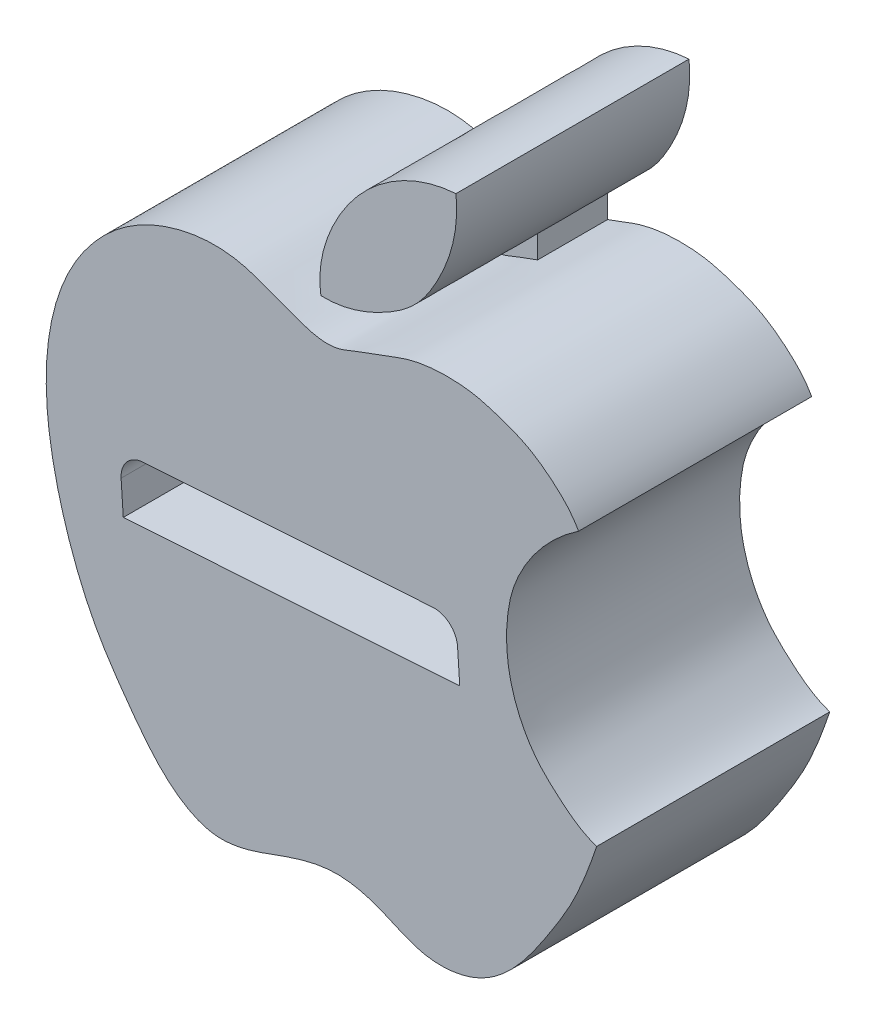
ISO-10303-21;
HEADER;
FILE_DESCRIPTION(('STEP AP214'),'2;1');
FILE_NAME('part.step','',(''),(''),'','','');
FILE_SCHEMA(('AUTOMOTIVE_DESIGN { 1 0 10303 214 1 1 1 1 }'));
ENDSEC;
DATA;
#1=APPLICATION_CONTEXT('core data for automotive mechanical design processes');
#2=APPLICATION_PROTOCOL_DEFINITION('international standard','automotive_design',2000,#1);
#3=PRODUCT_CONTEXT('',#1,'mechanical');
#4=PRODUCT('Part','Part','',(#3));
#5=PRODUCT_RELATED_PRODUCT_CATEGORY('part','',(#4));
#6=PRODUCT_DEFINITION_FORMATION('','',#4);
#7=PRODUCT_DEFINITION_CONTEXT('part definition',#1,'design');
#8=PRODUCT_DEFINITION('design','',#6,#7);
#9=PRODUCT_DEFINITION_SHAPE('','',#8);
#10=(LENGTH_UNIT() NAMED_UNIT(*) SI_UNIT(.MILLI.,.METRE.));
#11=(NAMED_UNIT(*) PLANE_ANGLE_UNIT() SI_UNIT($,.RADIAN.));
#12=(NAMED_UNIT(*) SI_UNIT($,.STERADIAN.) SOLID_ANGLE_UNIT());
#13=UNCERTAINTY_MEASURE_WITH_UNIT(LENGTH_MEASURE(1.E-05),#10,'distance_accuracy_value','');
#14=(GEOMETRIC_REPRESENTATION_CONTEXT(3) GLOBAL_UNCERTAINTY_ASSIGNED_CONTEXT((#13)) GLOBAL_UNIT_ASSIGNED_CONTEXT((#10,
#11,#12)) REPRESENTATION_CONTEXT('',''));
#15=CARTESIAN_POINT('',(0.,0.,0.));
#16=DIRECTION('',(0.,0.,1.));
#17=DIRECTION('',(1.,0.,0.));
#18=AXIS2_PLACEMENT_3D('',#15,#16,#17);
#19=CARTESIAN_POINT('',(0.,0.,8.04000000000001));
#20=DIRECTION('',(0.,0.,-1.));
#21=DIRECTION('',(-1.,0.,0.));
#22=AXIS2_PLACEMENT_3D('',#19,#20,#21);
#23=PLANE('',#22);
#24=CARTESIAN_POINT('',(-1.30439731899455,30.6275591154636,8.04000000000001));
#25=CARTESIAN_POINT('',(1.17170382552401,30.5323488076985,8.04000000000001));
#26=CARTESIAN_POINT('',(5.20814377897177,31.8743970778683,8.04000000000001));
#27=CARTESIAN_POINT('',(9.61925299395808,34.8715486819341,8.04000000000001));
#28=CARTESIAN_POINT('',(13.2082651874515,40.2179574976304,8.04000000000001));
#29=CARTESIAN_POINT('',(14.624235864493,44.8584265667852,8.04000000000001));
#30=CARTESIAN_POINT('',(14.2255959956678,48.5467821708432,8.04000000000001));
#31=B_SPLINE_CURVE_WITH_KNOTS('',3,(#24,#25,#26,#27,#28,#29,#30),.UNSPECIFIED.,.F.,.F.,(4,1,1,1,
4),(0.,0.278565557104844,0.466932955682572,0.591977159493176,1.),.UNSPECIFIED.);
#32=CARTESIAN_POINT('',(-0.595826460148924,30.624362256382,8.04000000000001));
#33=VERTEX_POINT('',#32);
#34=CARTESIAN_POINT('',(4.8644274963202,32.0378290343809,8.04000000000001));
#35=VERTEX_POINT('',#34);
#36=EDGE_CURVE('E323',#33,#35,#31,.T.);
#37=ORIENTED_EDGE('',*,*,#36,.F.);
#38=DIRECTION('',(0.,1.,0.));
#39=VECTOR('',#38,1.);
#40=CARTESIAN_POINT('',(-0.595826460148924,33.8676162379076,8.04000000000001));
#41=LINE('',#40,#39);
#42=CARTESIAN_POINT('',(-0.595826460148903,26.2107781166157,8.04000000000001));
#43=VERTEX_POINT('',#42);
#44=EDGE_CURVE('E341',#43,#33,#41,.T.);
#45=ORIENTED_EDGE('',*,*,#44,.F.);
#46=CARTESIAN_POINT('',(28.3338743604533,21.9899121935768,8.04000000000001));
#47=CARTESIAN_POINT('',(27.566223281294,23.3888004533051,8.04000000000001));
#48=CARTESIAN_POINT('',(25.6061119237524,25.3791627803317,8.04000000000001));
#49=CARTESIAN_POINT('',(22.4538332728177,27.6343701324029,8.04000000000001));
#50=CARTESIAN_POINT('',(19.355723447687,28.7819582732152,8.04000000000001));
#51=CARTESIAN_POINT('',(16.5009831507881,29.6520905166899,8.04000000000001));
#52=CARTESIAN_POINT('',(12.7573032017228,29.9875994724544,8.04000000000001));
#53=CARTESIAN_POINT('',(9.10170479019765,29.5975604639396,8.04000000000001));
#54=CARTESIAN_POINT('',(5.90197260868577,28.2026694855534,8.04000000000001));
#55=CARTESIAN_POINT('',(3.74738319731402,27.5362721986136,8.04000000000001));
#56=CARTESIAN_POINT('',(1.95422184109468,26.7437074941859,8.04000000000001));
#57=CARTESIAN_POINT('',(-0.175063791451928,26.0167706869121,8.04000000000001));
#58=CARTESIAN_POINT('',(-2.62736125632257,26.4244357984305,8.04000000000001));
#59=CARTESIAN_POINT('',(-5.22740617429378,27.4415420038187,8.04000000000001));
#60=CARTESIAN_POINT('',(-7.50514720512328,28.2751690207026,8.04000000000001));
#61=CARTESIAN_POINT('',(-10.4774063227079,29.3864994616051,8.04000000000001));
#62=CARTESIAN_POINT('',(-13.3357342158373,29.6886931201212,8.04000000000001));
#63=CARTESIAN_POINT('',(-16.0957339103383,29.3809933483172,8.04000000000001));
#64=CARTESIAN_POINT('',(-18.2818024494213,28.9050263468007,8.04000000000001));
#65=CARTESIAN_POINT('',(-21.4908628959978,27.7729425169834,8.04000000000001));
#66=CARTESIAN_POINT('',(-24.9847572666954,25.5534292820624,8.04000000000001));
#67=CARTESIAN_POINT('',(-27.8295654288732,22.5150842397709,8.04000000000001));
#68=CARTESIAN_POINT('',(-30.3002457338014,18.8598888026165,8.04000000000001));
#69=CARTESIAN_POINT('',(-31.79545647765,15.0351707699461,8.04000000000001));
#70=CARTESIAN_POINT('',(-32.5146380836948,11.5038655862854,8.04000000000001));
#71=CARTESIAN_POINT('',(-32.944851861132,8.01103223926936,8.04000000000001));
#72=CARTESIAN_POINT('',(-32.9112801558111,4.42622262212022,8.04000000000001));
#73=CARTESIAN_POINT('',(-32.2876350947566,-0.821748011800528,8.04000000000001));
#74=CARTESIAN_POINT('',(-30.677201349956,-7.58369844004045,8.04000000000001));
#75=CARTESIAN_POINT('',(-27.7076792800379,-15.0431657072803,8.04000000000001));
#76=CARTESIAN_POINT('',(-23.6894650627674,-20.7552513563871,8.04000000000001));
#77=CARTESIAN_POINT('',(-20.7758803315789,-24.6750399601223,8.04000000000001));
#78=CARTESIAN_POINT('',(-17.7596121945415,-27.6435665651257,8.04000000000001));
#79=CARTESIAN_POINT('',(-13.9005776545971,-29.475606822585,8.04000000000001));
#80=CARTESIAN_POINT('',(-10.0896494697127,-28.9906703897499,8.04000000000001));
#81=CARTESIAN_POINT('',(-5.44399413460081,-27.2654707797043,8.04000000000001));
#82=CARTESIAN_POINT('',(-0.226973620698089,-25.4327854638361,8.04000000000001));
#83=CARTESIAN_POINT('',(5.69524653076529,-26.9044483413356,8.04000000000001));
#84=CARTESIAN_POINT('',(10.531430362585,-29.6321207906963,8.04000000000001));
#85=CARTESIAN_POINT('',(16.9895631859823,-28.9209569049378,8.04000000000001));
#86=CARTESIAN_POINT('',(21.6405488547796,-24.7446787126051,8.04000000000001));
#87=CARTESIAN_POINT('',(24.796374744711,-20.0592238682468,8.04000000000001));
#88=CARTESIAN_POINT('',(28.0997989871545,-14.81288088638,8.04000000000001));
#89=CARTESIAN_POINT('',(29.5957094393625,-10.763632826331,8.04000000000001));
#90=CARTESIAN_POINT('',(30.4118179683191,-8.36296946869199,8.04000000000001));
#91=B_SPLINE_CURVE_WITH_KNOTS('',3,(#46,#47,#48,#49,#50,#51,#52,#53,#54,#55,#56,#57,#58,#59,#60,
#61,#62,#63,#64,#65,#66,#67,#68,#69,#70,#71,#72,#73,#74,#75,#76,#77,#78,#79,#80,#81,#82,#83,#84,
#85,#86,#87,#88,#89,#90),.UNSPECIFIED.,.F.,.F.,(4,1,1,1,1,1,1,1,1,1,1,1,1,1,1,1,1,1,1,1,1,1,1,1,
1,1,1,1,1,1,1,1,1,1,1,1,1,1,1,1,1,1,4),(0.,0.0267523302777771,0.0467336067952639,
0.0649968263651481,0.082321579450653,0.097011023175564,0.128365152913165,0.142995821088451,
0.155885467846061,0.166410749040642,0.176219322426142,0.193415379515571,0.206706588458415,
0.223677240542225,0.234360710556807,0.260338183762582,0.271136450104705,0.281276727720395,
0.298098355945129,0.328470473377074,0.350114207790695,0.368075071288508,0.402839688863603,
0.41856690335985,0.42895911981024,0.462303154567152,0.47881200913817,0.518263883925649,
0.579602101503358,0.612960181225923,0.636073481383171,0.662145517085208,0.684015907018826,
0.70548371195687,0.724700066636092,0.768618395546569,0.794907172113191,0.825219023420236,
0.861328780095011,0.895482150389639,0.927551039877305,0.957030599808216,1.),.UNSPECIFIED.);
#92=CARTESIAN_POINT('',(4.86442749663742,27.8855392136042,8.04000000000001));
#93=VERTEX_POINT('',#92);
#94=EDGE_CURVE('E255',#43,#93,#91,.F.);
#95=ORIENTED_EDGE('',*,*,#94,.T.);
#96=DIRECTION('',(0.,-1.,0.));
#97=VECTOR('',#96,1.);
#98=CARTESIAN_POINT('',(4.86442749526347,33.8676162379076,8.04000000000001));
#99=LINE('',#98,#97);
#100=EDGE_CURVE('E339',#35,#93,#99,.T.);
#101=ORIENTED_EDGE('',*,*,#100,.F.);
#102=EDGE_LOOP('',(#37,#45,#95,#101));
#103=FACE_BOUND('',#102,.T.);
#104=ADVANCED_FACE('F35',(#103),#23,.F.);
#105=CARTESIAN_POINT('',(4.86442749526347,33.8676162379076,8.04000000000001));
#106=DIRECTION('',(1.,0.,0.));
#107=DIRECTION('',(0.,0.,-1.));
#108=AXIS2_PLACEMENT_3D('',#105,#106,#107);
#109=PLANE('',#108);
#110=DIRECTION('',(0.,-1.,0.));
#111=VECTOR('',#110,1.);
#112=CARTESIAN_POINT('',(4.86442749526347,33.8676162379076,0.));
#113=LINE('',#112,#111);
#114=CARTESIAN_POINT('',(4.8644274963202,32.0378290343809,0.));
#115=VERTEX_POINT('',#114);
#116=CARTESIAN_POINT('',(4.86442749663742,27.8855392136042,0.));
#117=VERTEX_POINT('',#116);
#118=EDGE_CURVE('E338',#115,#117,#113,.T.);
#119=ORIENTED_EDGE('',*,*,#118,.F.);
#120=DIRECTION('',(0.,0.,-1.));
#121=VECTOR('',#120,1.);
#122=CARTESIAN_POINT('',(4.86442749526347,32.0378290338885,26.8));
#123=LINE('',#122,#121);
#124=EDGE_CURVE('E326',#115,#35,#123,.F.);
#125=ORIENTED_EDGE('',*,*,#124,.T.);
#126=ORIENTED_EDGE('',*,*,#100,.T.);
#127=DIRECTION('',(0.,0.,-1.));
#128=VECTOR('',#127,1.);
#129=CARTESIAN_POINT('',(4.86442749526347,27.8855392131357,26.8));
#130=LINE('',#129,#128);
#131=EDGE_CURVE('E350',#117,#93,#130,.F.);
#132=ORIENTED_EDGE('',*,*,#131,.F.);
#133=EDGE_LOOP('',(#119,#125,#126,#132));
#134=FACE_BOUND('',#133,.T.);
#135=ADVANCED_FACE('F197',(#134),#109,.T.);
#136=CARTESIAN_POINT('',(-0.595826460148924,33.8676162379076,8.04000000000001));
#137=DIRECTION('',(-1.,0.,0.));
#138=DIRECTION('',(0.,-1.,0.));
#139=AXIS2_PLACEMENT_3D('',#136,#137,#138);
#140=PLANE('',#139);
#141=ORIENTED_EDGE('',*,*,#44,.T.);
#142=DIRECTION('',(0.,0.,-1.));
#143=VECTOR('',#142,1.);
#144=CARTESIAN_POINT('',(-0.595826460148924,30.624362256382,26.8));
#145=LINE('',#144,#143);
#146=CARTESIAN_POINT('',(-0.595826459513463,30.6243622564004,0.));
#147=VERTEX_POINT('',#146);
#148=EDGE_CURVE('E260',#33,#147,#145,.T.);
#149=ORIENTED_EDGE('',*,*,#148,.T.);
#150=DIRECTION('',(0.,1.,0.));
#151=VECTOR('',#150,1.);
#152=CARTESIAN_POINT('',(-0.595826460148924,33.8676162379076,0.));
#153=LINE('',#152,#151);
#154=CARTESIAN_POINT('',(-0.595826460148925,26.2107781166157,0.));
#155=VERTEX_POINT('',#154);
#156=EDGE_CURVE('E342',#155,#147,#153,.T.);
#157=ORIENTED_EDGE('',*,*,#156,.F.);
#158=DIRECTION('',(0.,0.,-1.));
#159=VECTOR('',#158,1.);
#160=CARTESIAN_POINT('',(-0.595826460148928,26.2107781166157,26.8));
#161=LINE('',#160,#159);
#162=EDGE_CURVE('E345',#43,#155,#161,.T.);
#163=ORIENTED_EDGE('',*,*,#162,.F.);
#164=EDGE_LOOP('',(#141,#149,#157,#163));
#165=FACE_BOUND('',#164,.T.);
#166=ADVANCED_FACE('F199',(#165),#140,.T.);
#167=CARTESIAN_POINT('',(28.3338743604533,21.9899121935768,26.8));
#168=CARTESIAN_POINT('',(27.566223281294,23.3888004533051,26.8));
#169=CARTESIAN_POINT('',(25.6061119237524,25.3791627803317,26.8));
#170=CARTESIAN_POINT('',(22.4538332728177,27.6343701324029,26.8));
#171=CARTESIAN_POINT('',(19.355723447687,28.7819582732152,26.8));
#172=CARTESIAN_POINT('',(16.5009831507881,29.6520905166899,26.8));
#173=CARTESIAN_POINT('',(12.7573032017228,29.9875994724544,26.8));
#174=CARTESIAN_POINT('',(9.10170479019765,29.5975604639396,26.8));
#175=CARTESIAN_POINT('',(5.90197260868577,28.2026694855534,26.8));
#176=CARTESIAN_POINT('',(3.74738319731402,27.5362721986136,26.8));
#177=CARTESIAN_POINT('',(1.95422184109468,26.7437074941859,26.8));
#178=CARTESIAN_POINT('',(-0.175063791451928,26.0167706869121,26.8));
#179=CARTESIAN_POINT('',(-2.62736125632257,26.4244357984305,26.8));
#180=CARTESIAN_POINT('',(-5.22740617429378,27.4415420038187,26.8));
#181=CARTESIAN_POINT('',(-7.50514720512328,28.2751690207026,26.8));
#182=CARTESIAN_POINT('',(-10.4774063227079,29.3864994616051,26.8));
#183=CARTESIAN_POINT('',(-13.3357342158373,29.6886931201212,26.8));
#184=CARTESIAN_POINT('',(-16.0957339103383,29.3809933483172,26.8));
#185=CARTESIAN_POINT('',(-18.2818024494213,28.9050263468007,26.8));
#186=CARTESIAN_POINT('',(-21.4908628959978,27.7729425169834,26.8));
#187=CARTESIAN_POINT('',(-24.9847572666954,25.5534292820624,26.8));
#188=CARTESIAN_POINT('',(-27.8295654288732,22.5150842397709,26.8));
#189=CARTESIAN_POINT('',(-30.3002457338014,18.8598888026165,26.8));
#190=CARTESIAN_POINT('',(-31.79545647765,15.0351707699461,26.8));
#191=CARTESIAN_POINT('',(-32.5146380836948,11.5038655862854,26.8));
#192=CARTESIAN_POINT('',(-32.944851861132,8.01103223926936,26.8));
#193=CARTESIAN_POINT('',(-32.9112801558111,4.42622262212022,26.8));
#194=CARTESIAN_POINT('',(-32.2876350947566,-0.821748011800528,26.8));
#195=CARTESIAN_POINT('',(-30.677201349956,-7.58369844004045,26.8));
#196=CARTESIAN_POINT('',(-27.7076792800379,-15.0431657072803,26.8));
#197=CARTESIAN_POINT('',(-23.6894650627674,-20.7552513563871,26.8));
#198=CARTESIAN_POINT('',(-20.7758803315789,-24.6750399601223,26.8));
#199=CARTESIAN_POINT('',(-17.7596121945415,-27.6435665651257,26.8));
#200=CARTESIAN_POINT('',(-13.9005776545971,-29.475606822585,26.8));
#201=CARTESIAN_POINT('',(-10.0896494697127,-28.9906703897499,26.8));
#202=CARTESIAN_POINT('',(-5.44399413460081,-27.2654707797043,26.8));
#203=CARTESIAN_POINT('',(-0.226973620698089,-25.4327854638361,26.8));
#204=CARTESIAN_POINT('',(5.69524653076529,-26.9044483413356,26.8));
#205=CARTESIAN_POINT('',(10.531430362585,-29.6321207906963,26.8));
#206=CARTESIAN_POINT('',(16.9895631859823,-28.9209569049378,26.8));
#207=CARTESIAN_POINT('',(21.6405488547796,-24.7446787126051,26.8));
#208=CARTESIAN_POINT('',(24.796374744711,-20.0592238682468,26.8));
#209=CARTESIAN_POINT('',(28.0997989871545,-14.81288088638,26.8));
#210=CARTESIAN_POINT('',(29.5957094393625,-10.763632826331,26.8));
#211=CARTESIAN_POINT('',(30.4118179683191,-8.36296946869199,26.8));
#212=B_SPLINE_CURVE_WITH_KNOTS('',3,(#167,#168,#169,#170,#171,#172,#173,#174,#175,#176,#177,
#178,#179,#180,#181,#182,#183,#184,#185,#186,#187,#188,#189,#190,#191,#192,#193,#194,#195,#196,
#197,#198,#199,#200,#201,#202,#203,#204,#205,#206,#207,#208,#209,#210,#211),.UNSPECIFIED.,.F.,
.F.,(4,1,1,1,1,1,1,1,1,1,1,1,1,1,1,1,1,1,1,1,1,1,1,1,1,1,1,1,1,1,1,1,1,1,1,1,1,1,1,1,1,1,4),(0.,
0.0267523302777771,0.0467336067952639,0.0649968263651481,0.082321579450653,0.097011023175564,
0.128365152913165,0.142995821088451,0.155885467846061,0.166410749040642,0.176219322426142,
0.193415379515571,0.206706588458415,0.223677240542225,0.234360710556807,0.260338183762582,
0.271136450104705,0.281276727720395,0.298098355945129,0.328470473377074,0.350114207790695,
0.368075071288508,0.402839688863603,0.41856690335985,0.42895911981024,0.462303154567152,
0.47881200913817,0.518263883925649,0.579602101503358,0.612960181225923,0.636073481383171,
0.662145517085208,0.684015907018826,0.70548371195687,0.724700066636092,0.768618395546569,
0.794907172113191,0.825219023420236,0.861328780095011,0.895482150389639,0.927551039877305,
0.957030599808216,1.),.UNSPECIFIED.);
#213=DIRECTION('',(0.,0.,-1.));
#214=VECTOR('',#213,1.);
#215=SURFACE_OF_LINEAR_EXTRUSION('',#212,#214);
#216=CARTESIAN_POINT('',(28.3338743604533,21.9899121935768,0.));
#217=CARTESIAN_POINT('',(27.566223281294,23.3888004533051,0.));
#218=CARTESIAN_POINT('',(25.6061119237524,25.3791627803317,0.));
#219=CARTESIAN_POINT('',(22.4538332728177,27.6343701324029,0.));
#220=CARTESIAN_POINT('',(19.355723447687,28.7819582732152,0.));
#221=CARTESIAN_POINT('',(16.5009831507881,29.6520905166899,0.));
#222=CARTESIAN_POINT('',(12.7573032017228,29.9875994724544,0.));
#223=CARTESIAN_POINT('',(9.10170479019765,29.5975604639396,0.));
#224=CARTESIAN_POINT('',(5.90197260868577,28.2026694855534,0.));
#225=CARTESIAN_POINT('',(3.74738319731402,27.5362721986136,0.));
#226=CARTESIAN_POINT('',(1.95422184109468,26.7437074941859,0.));
#227=CARTESIAN_POINT('',(-0.175063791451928,26.0167706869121,0.));
#228=CARTESIAN_POINT('',(-2.62736125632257,26.4244357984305,0.));
#229=CARTESIAN_POINT('',(-5.22740617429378,27.4415420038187,0.));
#230=CARTESIAN_POINT('',(-7.50514720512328,28.2751690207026,0.));
#231=CARTESIAN_POINT('',(-10.4774063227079,29.3864994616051,0.));
#232=CARTESIAN_POINT('',(-13.3357342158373,29.6886931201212,0.));
#233=CARTESIAN_POINT('',(-16.0957339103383,29.3809933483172,0.));
#234=CARTESIAN_POINT('',(-18.2818024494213,28.9050263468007,0.));
#235=CARTESIAN_POINT('',(-21.4908628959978,27.7729425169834,0.));
#236=CARTESIAN_POINT('',(-24.9847572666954,25.5534292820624,0.));
#237=CARTESIAN_POINT('',(-27.8295654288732,22.5150842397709,0.));
#238=CARTESIAN_POINT('',(-30.3002457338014,18.8598888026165,0.));
#239=CARTESIAN_POINT('',(-31.79545647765,15.0351707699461,0.));
#240=CARTESIAN_POINT('',(-32.5146380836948,11.5038655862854,0.));
#241=CARTESIAN_POINT('',(-32.944851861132,8.01103223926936,0.));
#242=CARTESIAN_POINT('',(-32.9112801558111,4.42622262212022,0.));
#243=CARTESIAN_POINT('',(-32.2876350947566,-0.821748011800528,0.));
#244=CARTESIAN_POINT('',(-30.677201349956,-7.58369844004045,0.));
#245=CARTESIAN_POINT('',(-27.7076792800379,-15.0431657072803,0.));
#246=CARTESIAN_POINT('',(-23.6894650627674,-20.7552513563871,0.));
#247=CARTESIAN_POINT('',(-20.7758803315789,-24.6750399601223,0.));
#248=CARTESIAN_POINT('',(-17.7596121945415,-27.6435665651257,0.));
#249=CARTESIAN_POINT('',(-13.9005776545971,-29.475606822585,0.));
#250=CARTESIAN_POINT('',(-10.0896494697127,-28.9906703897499,0.));
#251=CARTESIAN_POINT('',(-5.44399413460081,-27.2654707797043,0.));
#252=CARTESIAN_POINT('',(-0.226973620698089,-25.4327854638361,0.));
#253=CARTESIAN_POINT('',(5.69524653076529,-26.9044483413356,0.));
#254=CARTESIAN_POINT('',(10.531430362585,-29.6321207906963,0.));
#255=CARTESIAN_POINT('',(16.9895631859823,-28.9209569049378,0.));
#256=CARTESIAN_POINT('',(21.6405488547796,-24.7446787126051,0.));
#257=CARTESIAN_POINT('',(24.796374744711,-20.0592238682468,0.));
#258=CARTESIAN_POINT('',(28.0997989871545,-14.81288088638,0.));
#259=CARTESIAN_POINT('',(29.5957094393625,-10.763632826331,0.));
#260=CARTESIAN_POINT('',(30.4118179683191,-8.36296946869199,0.));
#261=B_SPLINE_CURVE_WITH_KNOTS('',3,(#216,#217,#218,#219,#220,#221,#222,#223,#224,#225,#226,
#227,#228,#229,#230,#231,#232,#233,#234,#235,#236,#237,#238,#239,#240,#241,#242,#243,#244,#245,
#246,#247,#248,#249,#250,#251,#252,#253,#254,#255,#256,#257,#258,#259,#260),.UNSPECIFIED.,.F.,
.F.,(4,1,1,1,1,1,1,1,1,1,1,1,1,1,1,1,1,1,1,1,1,1,1,1,1,1,1,1,1,1,1,1,1,1,1,1,1,1,1,1,1,1,4),(0.,
0.0267523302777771,0.0467336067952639,0.0649968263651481,0.082321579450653,0.097011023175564,
0.128365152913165,0.142995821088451,0.155885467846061,0.166410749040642,0.176219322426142,
0.193415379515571,0.206706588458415,0.223677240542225,0.234360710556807,0.260338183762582,
0.271136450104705,0.281276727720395,0.298098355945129,0.328470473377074,0.350114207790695,
0.368075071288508,0.402839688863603,0.41856690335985,0.42895911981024,0.462303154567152,
0.47881200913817,0.518263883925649,0.579602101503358,0.612960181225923,0.636073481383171,
0.662145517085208,0.684015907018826,0.70548371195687,0.724700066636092,0.768618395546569,
0.794907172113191,0.825219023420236,0.861328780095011,0.895482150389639,0.927551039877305,
0.957030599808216,1.),.UNSPECIFIED.);
#262=CARTESIAN_POINT('',(28.3338743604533,21.9899121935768,0.));
#263=VERTEX_POINT('',#262);
#264=EDGE_CURVE('E231',#263,#117,#261,.T.);
#265=ORIENTED_EDGE('',*,*,#264,.T.);
#266=ORIENTED_EDGE('',*,*,#131,.T.);
#267=ORIENTED_EDGE('',*,*,#94,.F.);
#268=ORIENTED_EDGE('',*,*,#162,.T.);
#269=CARTESIAN_POINT('',(30.4118179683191,-8.36296946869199,0.));
#270=VERTEX_POINT('',#269);
#271=EDGE_CURVE('E240',#155,#270,#261,.T.);
#272=ORIENTED_EDGE('',*,*,#271,.T.);
#273=DIRECTION('',(0.,0.,-1.));
#274=VECTOR('',#273,1.);
#275=CARTESIAN_POINT('',(30.4118179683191,-8.36296946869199,26.8));
#276=LINE('',#275,#274);
#277=CARTESIAN_POINT('',(30.4118179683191,-8.36296946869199,26.8));
#278=VERTEX_POINT('',#277);
#279=EDGE_CURVE('E252',#278,#270,#276,.T.);
#280=ORIENTED_EDGE('',*,*,#279,.F.);
#281=CARTESIAN_POINT('',(28.3338743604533,21.9899121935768,26.8));
#282=VERTEX_POINT('',#281);
#283=EDGE_CURVE('E226',#282,#278,#212,.T.);
#284=ORIENTED_EDGE('',*,*,#283,.F.);
#285=DIRECTION('',(0.,0.,-1.));
#286=VECTOR('',#285,1.);
#287=CARTESIAN_POINT('',(28.3338743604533,21.9899121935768,26.8));
#288=LINE('',#287,#286);
#289=EDGE_CURVE('E225',#282,#263,#288,.T.);
#290=ORIENTED_EDGE('',*,*,#289,.T.);
#291=EDGE_LOOP('',(#265,#266,#267,#268,#272,#280,#284,#290));
#292=FACE_BOUND('',#291,.T.);
#293=ADVANCED_FACE('F202',(#292),#215,.F.);
#294=CARTESIAN_POINT('',(30.4118179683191,-8.36296946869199,26.8));
#295=CARTESIAN_POINT('',(28.6975146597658,-7.81177322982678,26.8));
#296=CARTESIAN_POINT('',(26.4543684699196,-6.08387144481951,26.8));
#297=CARTESIAN_POINT('',(23.364591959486,-3.20461551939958,26.8));
#298=CARTESIAN_POINT('',(21.3447823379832,0.170273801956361,26.8));
#299=CARTESIAN_POINT('',(20.0041239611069,4.65465031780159,26.8));
#300=CARTESIAN_POINT('',(19.9628668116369,8.78030082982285,26.8));
#301=CARTESIAN_POINT('',(20.5693578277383,11.9883546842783,26.8));
#302=CARTESIAN_POINT('',(22.3989073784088,16.7014090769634,26.8));
#303=CARTESIAN_POINT('',(25.3771571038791,20.0112909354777,26.8));
#304=CARTESIAN_POINT('',(28.3338743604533,21.9899121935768,26.8));
#305=B_SPLINE_CURVE_WITH_KNOTS('',3,(#294,#295,#296,#297,#298,#299,#300,#301,#302,#303,#304),
.UNSPECIFIED.,.F.,.F.,(4,1,1,1,1,1,1,1,4),(0.,0.142487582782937,0.22389540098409,
0.337763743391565,0.452510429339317,0.595809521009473,0.663480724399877,0.71307028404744,1.),.UNSPECIFIED.);
#306=DIRECTION('',(0.,0.,-1.));
#307=VECTOR('',#306,1.);
#308=SURFACE_OF_LINEAR_EXTRUSION('',#305,#307);
#309=CARTESIAN_POINT('',(30.4118179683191,-8.36296946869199,0.));
#310=CARTESIAN_POINT('',(28.6975146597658,-7.81177322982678,0.));
#311=CARTESIAN_POINT('',(26.4543684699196,-6.08387144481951,0.));
#312=CARTESIAN_POINT('',(23.364591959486,-3.20461551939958,0.));
#313=CARTESIAN_POINT('',(21.3447823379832,0.170273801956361,0.));
#314=CARTESIAN_POINT('',(20.0041239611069,4.65465031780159,0.));
#315=CARTESIAN_POINT('',(19.9628668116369,8.78030082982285,0.));
#316=CARTESIAN_POINT('',(20.5693578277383,11.9883546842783,0.));
#317=CARTESIAN_POINT('',(22.3989073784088,16.7014090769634,0.));
#318=CARTESIAN_POINT('',(25.3771571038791,20.0112909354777,0.));
#319=CARTESIAN_POINT('',(28.3338743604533,21.9899121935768,0.));
#320=B_SPLINE_CURVE_WITH_KNOTS('',3,(#309,#310,#311,#312,#313,#314,#315,#316,#317,#318,#319),
.UNSPECIFIED.,.F.,.F.,(4,1,1,1,1,1,1,1,4),(0.,0.142487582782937,0.22389540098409,
0.337763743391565,0.452510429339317,0.595809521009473,0.663480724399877,0.71307028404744,1.),.UNSPECIFIED.);
#321=EDGE_CURVE('E239',#270,#263,#320,.T.);
#322=ORIENTED_EDGE('',*,*,#321,.T.);
#323=ORIENTED_EDGE('',*,*,#289,.F.);
#324=EDGE_CURVE('E220',#278,#282,#305,.T.);
#325=ORIENTED_EDGE('',*,*,#324,.F.);
#326=ORIENTED_EDGE('',*,*,#279,.T.);
#327=EDGE_LOOP('',(#322,#323,#325,#326));
#328=FACE_BOUND('',#327,.T.);
#329=ADVANCED_FACE('F210',(#328),#308,.F.);
#330=CARTESIAN_POINT('',(-31.6912117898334,-3.15546408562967,26.8));
#331=DIRECTION('',(0.,0.,-1.));
#332=DIRECTION('',(-1.,0.,0.));
#333=AXIS2_PLACEMENT_3D('',#330,#331,#332);
#334=PLANE('',#333);
#335=DIRECTION('',(0.997805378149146,0.0662150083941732,0.));
#336=VECTOR('',#335,1.);
#337=CARTESIAN_POINT('',(-24.0251352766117,-2.82259679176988,26.8));
#338=LINE('',#337,#336);
#339=CARTESIAN_POINT('',(-24.0251352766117,-2.82259679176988,26.8));
#340=VERTEX_POINT('',#339);
#341=CARTESIAN_POINT('',(14.6649054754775,-0.255100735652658,26.8));
#342=VERTEX_POINT('',#341);
#343=EDGE_CURVE('E162',#340,#342,#338,.T.);
#344=ORIENTED_EDGE('',*,*,#343,.F.);
#345=DIRECTION('',(0.066215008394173,-0.997805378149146,0.));
#346=VECTOR('',#345,1.);
#347=CARTESIAN_POINT('',(-24.4537454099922,3.63620320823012,26.8));
#348=LINE('',#347,#346);
#349=CARTESIAN_POINT('',(-24.2762891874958,0.962084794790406,26.8));
#350=VERTEX_POINT('',#349);
#351=EDGE_CURVE('E147',#350,#340,#348,.T.);
#352=ORIENTED_EDGE('',*,*,#351,.F.);
#353=CARTESIAN_POINT('',(-21.6021707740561,1.13954101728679,26.8));
#354=DIRECTION('',(0.,0.,-1.));
#355=DIRECTION('',(-1.,0.,0.));
#356=AXIS2_PLACEMENT_3D('',#353,#354,#355);
#357=CIRCLE('',#356,2.68);
#358=CARTESIAN_POINT('',(-21.7796269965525,3.8136594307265,26.8));
#359=VERTEX_POINT('',#358);
#360=EDGE_CURVE('E11',#350,#359,#357,.T.);
#361=ORIENTED_EDGE('',*,*,#360,.T.);
#362=DIRECTION('',(-0.997805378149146,-0.0662150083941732,0.));
#363=VECTOR('',#362,1.);
#364=CARTESIAN_POINT('',(-24.4537454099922,3.63620320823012,26.8));
#365=LINE('',#364,#363);
#366=CARTESIAN_POINT('',(11.5621769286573,6.02624304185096,26.8));
#367=VERTEX_POINT('',#366);
#368=EDGE_CURVE('E141',#367,#359,#365,.T.);
#369=ORIENTED_EDGE('',*,*,#368,.F.);
#370=CARTESIAN_POINT('',(11.7396331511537,3.35212462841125,26.8));
#371=DIRECTION('',(0.,0.,-1.));
#372=DIRECTION('',(-1.,0.,0.));
#373=AXIS2_PLACEMENT_3D('',#370,#371,#372);
#374=CIRCLE('',#373,2.68);
#375=CARTESIAN_POINT('',(14.4137515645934,3.52958085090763,26.8));
#376=VERTEX_POINT('',#375);
#377=EDGE_CURVE('E43',#367,#376,#374,.T.);
#378=ORIENTED_EDGE('',*,*,#377,.T.);
#379=DIRECTION('',(-0.0662150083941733,0.997805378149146,0.));
#380=VECTOR('',#379,1.);
#381=CARTESIAN_POINT('',(14.236295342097,6.20369926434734,26.8));
#382=LINE('',#381,#380);
#383=EDGE_CURVE('E164',#342,#376,#382,.T.);
#384=ORIENTED_EDGE('',*,*,#383,.F.);
#385=EDGE_LOOP('',(#344,#352,#361,#369,#378,#384));
#386=FACE_BOUND('',#385,.T.);
#387=ORIENTED_EDGE('',*,*,#283,.T.);
#388=ORIENTED_EDGE('',*,*,#324,.T.);
#389=EDGE_LOOP('',(#387,#388));
#390=FACE_BOUND('',#389,.T.);
#391=ADVANCED_FACE('F207',(#386,#390),#334,.F.);
#392=CARTESIAN_POINT('',(-31.6912117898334,-3.15546408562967,0.));
#393=DIRECTION('',(0.,0.,-1.));
#394=DIRECTION('',(-1.,0.,0.));
#395=AXIS2_PLACEMENT_3D('',#392,#393,#394);
#396=PLANE('',#395);
#397=CARTESIAN_POINT('',(-1.30439731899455,30.6275591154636,0.));
#398=CARTESIAN_POINT('',(1.17170382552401,30.5323488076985,0.));
#399=CARTESIAN_POINT('',(5.20814377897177,31.8743970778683,0.));
#400=CARTESIAN_POINT('',(9.61925299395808,34.8715486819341,0.));
#401=CARTESIAN_POINT('',(13.2082651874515,40.2179574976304,0.));
#402=CARTESIAN_POINT('',(14.624235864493,44.8584265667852,0.));
#403=CARTESIAN_POINT('',(14.2255959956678,48.5467821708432,0.));
#404=B_SPLINE_CURVE_WITH_KNOTS('',3,(#397,#398,#399,#400,#401,#402,#403),.UNSPECIFIED.,.F.,.F.,
(4,1,1,1,4),(0.,0.278565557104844,0.466932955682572,0.591977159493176,1.),.UNSPECIFIED.);
#405=CARTESIAN_POINT('',(14.2255959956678,48.5467821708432,0.));
#406=VERTEX_POINT('',#405);
#407=EDGE_CURVE('E169',#115,#406,#404,.T.);
#408=ORIENTED_EDGE('',*,*,#407,.F.);
#409=ORIENTED_EDGE('',*,*,#118,.T.);
#410=ORIENTED_EDGE('',*,*,#264,.F.);
#411=ORIENTED_EDGE('',*,*,#321,.F.);
#412=ORIENTED_EDGE('',*,*,#271,.F.);
#413=ORIENTED_EDGE('',*,*,#156,.T.);
#414=CARTESIAN_POINT('',(-1.30439731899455,30.6275591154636,0.));
#415=VERTEX_POINT('',#414);
#416=EDGE_CURVE('E367',#415,#147,#404,.T.);
#417=ORIENTED_EDGE('',*,*,#416,.F.);
#418=CARTESIAN_POINT('',(14.2255959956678,48.5467821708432,0.));
#419=CARTESIAN_POINT('',(10.5965788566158,48.3098142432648,0.));
#420=CARTESIAN_POINT('',(4.89032575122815,45.6057623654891,0.));
#421=CARTESIAN_POINT('',(-0.367350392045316,38.4682935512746,0.));
#422=CARTESIAN_POINT('',(-1.71186652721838,33.3647697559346,0.));
#423=CARTESIAN_POINT('',(-1.30439731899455,30.6275591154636,0.));
#424=B_SPLINE_CURVE_WITH_KNOTS('',3,(#418,#419,#420,#421,#422,#423),.UNSPECIFIED.,.F.,.F.,(4,1,
1,4),(0.,0.415055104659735,0.68612969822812,1.),.UNSPECIFIED.);
#425=EDGE_CURVE('E178',#406,#415,#424,.T.);
#426=ORIENTED_EDGE('',*,*,#425,.F.);
#427=EDGE_LOOP('',(#408,#409,#410,#411,#412,#413,#417,#426));
#428=FACE_BOUND('',#427,.T.);
#429=ADVANCED_FACE('F192',(#428),#396,.T.);
#430=CARTESIAN_POINT('',(-1.30439731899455,30.6275591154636,26.8));
#431=CARTESIAN_POINT('',(1.17170382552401,30.5323488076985,26.8));
#432=CARTESIAN_POINT('',(5.20814377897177,31.8743970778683,26.8));
#433=CARTESIAN_POINT('',(9.61925299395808,34.8715486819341,26.8));
#434=CARTESIAN_POINT('',(13.2082651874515,40.2179574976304,26.8));
#435=CARTESIAN_POINT('',(14.624235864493,44.8584265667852,26.8));
#436=CARTESIAN_POINT('',(14.2255959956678,48.5467821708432,26.8));
#437=B_SPLINE_CURVE_WITH_KNOTS('',3,(#430,#431,#432,#433,#434,#435,#436),.UNSPECIFIED.,.F.,.F.,
(4,1,1,1,4),(0.,0.278565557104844,0.466932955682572,0.591977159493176,1.),.UNSPECIFIED.);
#438=DIRECTION('',(0.,0.,-1.));
#439=VECTOR('',#438,1.);
#440=SURFACE_OF_LINEAR_EXTRUSION('',#437,#439);
#441=ORIENTED_EDGE('',*,*,#124,.F.);
#442=ORIENTED_EDGE('',*,*,#407,.T.);
#443=DIRECTION('',(0.,0.,-1.));
#444=VECTOR('',#443,1.);
#445=CARTESIAN_POINT('',(14.2255959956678,48.5467821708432,26.8));
#446=LINE('',#445,#444);
#447=CARTESIAN_POINT('',(14.2255959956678,48.5467821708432,26.8));
#448=VERTEX_POINT('',#447);
#449=EDGE_CURVE('E320',#448,#406,#446,.T.);
#450=ORIENTED_EDGE('',*,*,#449,.F.);
#451=CARTESIAN_POINT('',(-1.30439731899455,30.6275591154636,26.8));
#452=VERTEX_POINT('',#451);
#453=EDGE_CURVE('E171',#452,#448,#437,.T.);
#454=ORIENTED_EDGE('',*,*,#453,.F.);
#455=DIRECTION('',(0.,0.,-1.));
#456=VECTOR('',#455,1.);
#457=CARTESIAN_POINT('',(-1.30439731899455,30.6275591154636,26.8));
#458=LINE('',#457,#456);
#459=EDGE_CURVE('E324',#452,#415,#458,.T.);
#460=ORIENTED_EDGE('',*,*,#459,.T.);
#461=ORIENTED_EDGE('',*,*,#416,.T.);
#462=ORIENTED_EDGE('',*,*,#148,.F.);
#463=ORIENTED_EDGE('',*,*,#36,.T.);
#464=EDGE_LOOP('',(#441,#442,#450,#454,#460,#461,#462,#463));
#465=FACE_BOUND('',#464,.T.);
#466=ADVANCED_FACE('F187',(#465),#440,.F.);
#467=CARTESIAN_POINT('',(14.2255959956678,48.5467821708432,26.8));
#468=CARTESIAN_POINT('',(10.5965788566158,48.3098142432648,26.8));
#469=CARTESIAN_POINT('',(4.89032575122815,45.6057623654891,26.8));
#470=CARTESIAN_POINT('',(-0.367350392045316,38.4682935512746,26.8));
#471=CARTESIAN_POINT('',(-1.71186652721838,33.3647697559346,26.8));
#472=CARTESIAN_POINT('',(-1.30439731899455,30.6275591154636,26.8));
#473=B_SPLINE_CURVE_WITH_KNOTS('',3,(#467,#468,#469,#470,#471,#472),.UNSPECIFIED.,.F.,.F.,(4,1,
1,4),(0.,0.415055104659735,0.68612969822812,1.),.UNSPECIFIED.);
#474=DIRECTION('',(0.,0.,-1.));
#475=VECTOR('',#474,1.);
#476=SURFACE_OF_LINEAR_EXTRUSION('',#473,#475);
#477=ORIENTED_EDGE('',*,*,#425,.T.);
#478=ORIENTED_EDGE('',*,*,#459,.F.);
#479=EDGE_CURVE('E177',#448,#452,#473,.T.);
#480=ORIENTED_EDGE('',*,*,#479,.F.);
#481=ORIENTED_EDGE('',*,*,#449,.T.);
#482=EDGE_LOOP('',(#477,#478,#480,#481));
#483=FACE_BOUND('',#482,.T.);
#484=ADVANCED_FACE('F191',(#483),#476,.F.);
#485=CARTESIAN_POINT('',(10.3773528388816,36.1233023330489,26.8));
#486=DIRECTION('',(0.,0.,-1.));
#487=DIRECTION('',(-1.,0.,0.));
#488=AXIS2_PLACEMENT_3D('',#485,#486,#487);
#489=PLANE('',#488);
#490=ORIENTED_EDGE('',*,*,#453,.T.);
#491=ORIENTED_EDGE('',*,*,#479,.T.);
#492=EDGE_LOOP('',(#490,#491));
#493=FACE_BOUND('',#492,.T.);
#494=ADVANCED_FACE('F308',(#493),#489,.F.);
#495=CARTESIAN_POINT('',(-24.4537454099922,3.63620320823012,6.16399999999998));
#496=DIRECTION('',(-0.997805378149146,-0.066215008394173,0.));
#497=DIRECTION('',(0.066215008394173,-0.997805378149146,0.));
#498=AXIS2_PLACEMENT_3D('',#495,#496,#497);
#499=PLANE('',#498);
#500=DIRECTION('',(0.066215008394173,-0.997805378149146,0.));
#501=VECTOR('',#500,1.);
#502=CARTESIAN_POINT('',(-24.4537454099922,3.63620320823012,6.16399999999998));
#503=LINE('',#502,#501);
#504=CARTESIAN_POINT('',(-24.2762891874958,0.962084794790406,6.16399999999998));
#505=VERTEX_POINT('',#504);
#506=CARTESIAN_POINT('',(-24.0251352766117,-2.82259679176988,6.16399999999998));
#507=VERTEX_POINT('',#506);
#508=EDGE_CURVE('E134',#505,#507,#503,.T.);
#509=ORIENTED_EDGE('',*,*,#508,.F.);
#510=DIRECTION('',(0.,0.,1.));
#511=VECTOR('',#510,1.);
#512=CARTESIAN_POINT('',(-24.2762891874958,0.962084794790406,26.8));
#513=LINE('',#512,#511);
#514=EDGE_CURVE('E276',#505,#350,#513,.T.);
#515=ORIENTED_EDGE('',*,*,#514,.T.);
#516=ORIENTED_EDGE('',*,*,#351,.T.);
#517=DIRECTION('',(0.,0.,1.));
#518=VECTOR('',#517,1.);
#519=CARTESIAN_POINT('',(-24.0251352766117,-2.82259679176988,6.16399999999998));
#520=LINE('',#519,#518);
#521=EDGE_CURVE('E144',#507,#340,#520,.T.);
#522=ORIENTED_EDGE('',*,*,#521,.F.);
#523=EDGE_LOOP('',(#509,#515,#516,#522));
#524=FACE_BOUND('',#523,.T.);
#525=ADVANCED_FACE('F145',(#524),#499,.F.);
#526=CARTESIAN_POINT('',(-24.4537454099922,3.63620320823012,6.16399999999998));
#527=DIRECTION('',(-0.0662150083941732,0.997805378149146,0.));
#528=DIRECTION('',(-0.997805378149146,-0.0662150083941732,0.));
#529=AXIS2_PLACEMENT_3D('',#526,#527,#528);
#530=PLANE('',#529);
#531=DIRECTION('',(-0.997805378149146,-0.0662150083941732,0.));
#532=VECTOR('',#531,1.);
#533=CARTESIAN_POINT('',(-24.4537454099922,3.63620320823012,6.16399999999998));
#534=LINE('',#533,#532);
#535=CARTESIAN_POINT('',(11.5621769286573,6.02624304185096,6.16399999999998));
#536=VERTEX_POINT('',#535);
#537=CARTESIAN_POINT('',(-21.7796269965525,3.8136594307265,6.16399999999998));
#538=VERTEX_POINT('',#537);
#539=EDGE_CURVE('E152',#536,#538,#534,.T.);
#540=ORIENTED_EDGE('',*,*,#539,.F.);
#541=DIRECTION('',(0.,0.,1.));
#542=VECTOR('',#541,1.);
#543=CARTESIAN_POINT('',(11.5621769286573,6.02624304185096,26.8));
#544=LINE('',#543,#542);
#545=EDGE_CURVE('E268',#536,#367,#544,.T.);
#546=ORIENTED_EDGE('',*,*,#545,.T.);
#547=ORIENTED_EDGE('',*,*,#368,.T.);
#548=DIRECTION('',(0.,0.,1.));
#549=VECTOR('',#548,1.);
#550=CARTESIAN_POINT('',(-21.7796269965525,3.8136594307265,6.16399999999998));
#551=LINE('',#550,#549);
#552=EDGE_CURVE('E266',#359,#538,#551,.F.);
#553=ORIENTED_EDGE('',*,*,#552,.T.);
#554=EDGE_LOOP('',(#540,#546,#547,#553));
#555=FACE_BOUND('',#554,.T.);
#556=ADVANCED_FACE('F289',(#555),#530,.F.);
#557=CARTESIAN_POINT('',(14.236295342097,6.20369926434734,6.16399999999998));
#558=DIRECTION('',(0.997805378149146,0.0662150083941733,0.));
#559=DIRECTION('',(-0.0662150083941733,0.997805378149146,0.));
#560=AXIS2_PLACEMENT_3D('',#557,#558,#559);
#561=PLANE('',#560);
#562=ORIENTED_EDGE('',*,*,#383,.T.);
#563=DIRECTION('',(0.,0.,1.));
#564=VECTOR('',#563,1.);
#565=CARTESIAN_POINT('',(14.4137515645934,3.52958085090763,6.16399999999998));
#566=LINE('',#565,#564);
#567=CARTESIAN_POINT('',(14.4137515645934,3.52958085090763,6.16399999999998));
#568=VERTEX_POINT('',#567);
#569=EDGE_CURVE('E271',#376,#568,#566,.F.);
#570=ORIENTED_EDGE('',*,*,#569,.T.);
#571=DIRECTION('',(-0.0662150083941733,0.997805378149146,0.));
#572=VECTOR('',#571,1.);
#573=CARTESIAN_POINT('',(14.236295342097,6.20369926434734,6.16399999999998));
#574=LINE('',#573,#572);
#575=CARTESIAN_POINT('',(14.6649054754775,-0.255100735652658,6.16399999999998));
#576=VERTEX_POINT('',#575);
#577=EDGE_CURVE('E156',#576,#568,#574,.T.);
#578=ORIENTED_EDGE('',*,*,#577,.F.);
#579=DIRECTION('',(0.,0.,1.));
#580=VECTOR('',#579,1.);
#581=CARTESIAN_POINT('',(14.6649054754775,-0.255100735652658,6.16399999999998));
#582=LINE('',#581,#580);
#583=EDGE_CURVE('E151',#576,#342,#582,.T.);
#584=ORIENTED_EDGE('',*,*,#583,.T.);
#585=EDGE_LOOP('',(#562,#570,#578,#584));
#586=FACE_BOUND('',#585,.T.);
#587=ADVANCED_FACE('F284',(#586),#561,.F.);
#588=CARTESIAN_POINT('',(-24.0251352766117,-2.82259679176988,6.16399999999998));
#589=DIRECTION('',(0.0662150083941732,-0.997805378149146,0.));
#590=DIRECTION('',(0.997805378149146,0.0662150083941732,0.));
#591=AXIS2_PLACEMENT_3D('',#588,#589,#590);
#592=PLANE('',#591);
#593=ORIENTED_EDGE('',*,*,#343,.T.);
#594=ORIENTED_EDGE('',*,*,#583,.F.);
#595=DIRECTION('',(0.997805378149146,0.0662150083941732,0.));
#596=VECTOR('',#595,1.);
#597=CARTESIAN_POINT('',(-24.0251352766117,-2.82259679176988,6.16399999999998));
#598=LINE('',#597,#596);
#599=EDGE_CURVE('E139',#507,#576,#598,.T.);
#600=ORIENTED_EDGE('',*,*,#599,.F.);
#601=ORIENTED_EDGE('',*,*,#521,.T.);
#602=EDGE_LOOP('',(#593,#594,#600,#601));
#603=FACE_BOUND('',#602,.T.);
#604=ADVANCED_FACE('F154',(#603),#592,.F.);
#605=CARTESIAN_POINT('',(0.,0.,6.16399999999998));
#606=DIRECTION('',(0.,0.,1.));
#607=DIRECTION('',(1.,0.,0.));
#608=AXIS2_PLACEMENT_3D('',#605,#606,#607);
#609=PLANE('',#608);
#610=ORIENTED_EDGE('',*,*,#577,.T.);
#611=CARTESIAN_POINT('',(11.7396331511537,3.35212462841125,6.16399999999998));
#612=DIRECTION('',(0.,0.,1.));
#613=DIRECTION('',(1.,0.,0.));
#614=AXIS2_PLACEMENT_3D('',#611,#612,#613);
#615=CIRCLE('',#614,2.68);
#616=EDGE_CURVE('E274',#568,#536,#615,.T.);
#617=ORIENTED_EDGE('',*,*,#616,.T.);
#618=ORIENTED_EDGE('',*,*,#539,.T.);
#619=CARTESIAN_POINT('',(-21.6021707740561,1.13954101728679,6.16399999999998));
#620=DIRECTION('',(0.,0.,1.));
#621=DIRECTION('',(1.,0.,0.));
#622=AXIS2_PLACEMENT_3D('',#619,#620,#621);
#623=CIRCLE('',#622,2.68);
#624=EDGE_CURVE('E56',#538,#505,#623,.T.);
#625=ORIENTED_EDGE('',*,*,#624,.T.);
#626=ORIENTED_EDGE('',*,*,#508,.T.);
#627=ORIENTED_EDGE('',*,*,#599,.T.);
#628=EDGE_LOOP('',(#610,#617,#618,#625,#626,#627));
#629=FACE_BOUND('',#628,.T.);
#630=ADVANCED_FACE('F137',(#629),#609,.T.);
#631=CARTESIAN_POINT('',(11.7396331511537,3.35212462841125,6.16399999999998));
#632=DIRECTION('',(0.,0.,-1.));
#633=DIRECTION('',(-1.,0.,0.));
#634=AXIS2_PLACEMENT_3D('',#631,#632,#633);
#635=CYLINDRICAL_SURFACE('',#634,2.68);
#636=ORIENTED_EDGE('',*,*,#616,.F.);
#637=ORIENTED_EDGE('',*,*,#569,.F.);
#638=ORIENTED_EDGE('',*,*,#377,.F.);
#639=ORIENTED_EDGE('',*,*,#545,.F.);
#640=EDGE_LOOP('',(#636,#637,#638,#639));
#641=FACE_BOUND('',#640,.T.);
#642=ADVANCED_FACE('F286',(#641),#635,.F.);
#643=CARTESIAN_POINT('',(-21.6021707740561,1.13954101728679,6.16399999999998));
#644=DIRECTION('',(0.,0.,-1.));
#645=DIRECTION('',(-1.,0.,0.));
#646=AXIS2_PLACEMENT_3D('',#643,#644,#645);
#647=CYLINDRICAL_SURFACE('',#646,2.68);
#648=ORIENTED_EDGE('',*,*,#624,.F.);
#649=ORIENTED_EDGE('',*,*,#552,.F.);
#650=ORIENTED_EDGE('',*,*,#360,.F.);
#651=ORIENTED_EDGE('',*,*,#514,.F.);
#652=EDGE_LOOP('',(#648,#649,#650,#651));
#653=FACE_BOUND('',#652,.T.);
#654=ADVANCED_FACE('F37',(#653),#647,.F.);
#655=CLOSED_SHELL('',(#104,#135,#166,#293,#329,#391,#429,#466,#484,#494,#525,#556,#587,#604,
#630,#642,#654));
#656=MANIFOLD_SOLID_BREP('B2',#655);
#657=ADVANCED_BREP_SHAPE_REPRESENTATION('',(#18,#656),#14);
#658=SHAPE_DEFINITION_REPRESENTATION(#9,#657);
ENDSEC;
END-ISO-10303-21;
